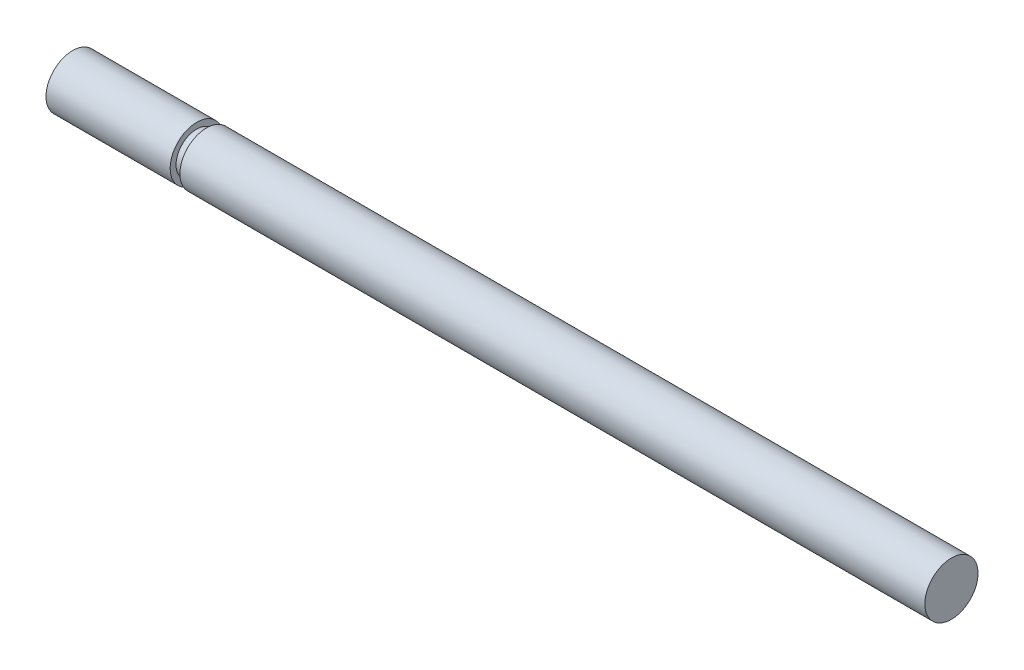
ISO-10303-21;
HEADER;
FILE_DESCRIPTION(('STEP AP214'),'2;1');
FILE_NAME('part.step','',(''),(''),'','','');
FILE_SCHEMA(('AUTOMOTIVE_DESIGN { 1 0 10303 214 1 1 1 1 }'));
ENDSEC;
DATA;
#1=APPLICATION_CONTEXT('core data for automotive mechanical design processes');
#2=APPLICATION_PROTOCOL_DEFINITION('international standard','automotive_design',2000,#1);
#3=PRODUCT_CONTEXT('',#1,'mechanical');
#4=PRODUCT('Part','Part','',(#3));
#5=PRODUCT_RELATED_PRODUCT_CATEGORY('part','',(#4));
#6=PRODUCT_DEFINITION_FORMATION('','',#4);
#7=PRODUCT_DEFINITION_CONTEXT('part definition',#1,'design');
#8=PRODUCT_DEFINITION('design','',#6,#7);
#9=PRODUCT_DEFINITION_SHAPE('','',#8);
#10=(LENGTH_UNIT() NAMED_UNIT(*) SI_UNIT(.MILLI.,.METRE.));
#11=(NAMED_UNIT(*) PLANE_ANGLE_UNIT() SI_UNIT($,.RADIAN.));
#12=(NAMED_UNIT(*) SI_UNIT($,.STERADIAN.) SOLID_ANGLE_UNIT());
#13=UNCERTAINTY_MEASURE_WITH_UNIT(LENGTH_MEASURE(1.E-05),#10,'distance_accuracy_value','');
#14=(GEOMETRIC_REPRESENTATION_CONTEXT(3) GLOBAL_UNCERTAINTY_ASSIGNED_CONTEXT((#13)) GLOBAL_UNIT_ASSIGNED_CONTEXT((#10,
#11,#12)) REPRESENTATION_CONTEXT('',''));
#15=CARTESIAN_POINT('',(0.,0.,0.));
#16=DIRECTION('',(0.,0.,1.));
#17=DIRECTION('',(1.,0.,0.));
#18=AXIS2_PLACEMENT_3D('',#15,#16,#17);
#19=CARTESIAN_POINT('',(1.125,0.,0.));
#20=DIRECTION('',(1.,0.,0.));
#21=DIRECTION('',(0.,0.,-1.));
#22=AXIS2_PLACEMENT_3D('',#19,#20,#21);
#23=PLANE('',#22);
#24=CARTESIAN_POINT('',(1.125,0.,0.));
#25=DIRECTION('',(-1.,0.,0.));
#26=DIRECTION('',(0.,0.,1.));
#27=AXIS2_PLACEMENT_3D('',#24,#25,#26);
#28=CIRCLE('',#27,1.5);
#29=CARTESIAN_POINT('',(1.125,0.,1.5));
#30=VERTEX_POINT('',#29);
#31=EDGE_CURVE('E10',#30,#30,#28,.T.);
#32=ORIENTED_EDGE('',*,*,#31,.T.);
#33=EDGE_LOOP('',(#32));
#34=FACE_BOUND('',#33,.T.);
#35=ADVANCED_FACE('F41',(#34),#23,.F.);
#36=CARTESIAN_POINT('',(0.,0.,0.));
#37=DIRECTION('',(-1.,0.,0.));
#38=DIRECTION('',(0.,0.,1.));
#39=AXIS2_PLACEMENT_3D('',#36,#37,#38);
#40=CYLINDRICAL_SURFACE('',#39,1.5);
#41=ORIENTED_EDGE('',*,*,#31,.F.);
#42=EDGE_LOOP('',(#41));
#43=FACE_BOUND('',#42,.T.);
#44=CARTESIAN_POINT('',(8.125,0.,0.));
#45=DIRECTION('',(-1.,0.,0.));
#46=DIRECTION('',(0.,0.,1.));
#47=AXIS2_PLACEMENT_3D('',#44,#45,#46);
#48=CIRCLE('',#47,1.5);
#49=CARTESIAN_POINT('',(8.125,0.,1.5));
#50=VERTEX_POINT('',#49);
#51=EDGE_CURVE('E50',#50,#50,#48,.T.);
#52=ORIENTED_EDGE('',*,*,#51,.T.);
#53=EDGE_LOOP('',(#52));
#54=FACE_BOUND('',#53,.T.);
#55=ADVANCED_FACE('F80',(#43,#54),#40,.T.);
#56=CARTESIAN_POINT('',(8.125,1.5,0.));
#57=DIRECTION('',(-1.,0.,0.));
#58=DIRECTION('',(0.,0.,1.));
#59=AXIS2_PLACEMENT_3D('',#56,#57,#58);
#60=PLANE('',#59);
#61=ORIENTED_EDGE('',*,*,#51,.F.);
#62=EDGE_LOOP('',(#61));
#63=FACE_BOUND('',#62,.T.);
#64=CARTESIAN_POINT('',(8.125,0.,0.));
#65=DIRECTION('',(-1.,0.,0.));
#66=DIRECTION('',(0.,0.,1.));
#67=AXIS2_PLACEMENT_3D('',#64,#65,#66);
#68=CIRCLE('',#67,1.16666666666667);
#69=CARTESIAN_POINT('',(8.125,0.,1.16666666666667));
#70=VERTEX_POINT('',#69);
#71=EDGE_CURVE('E51',#70,#70,#68,.T.);
#72=ORIENTED_EDGE('',*,*,#71,.T.);
#73=EDGE_LOOP('',(#72));
#74=FACE_BOUND('',#73,.T.);
#75=ADVANCED_FACE('F81',(#63,#74),#60,.F.);
#76=CARTESIAN_POINT('',(0.,0.,0.));
#77=DIRECTION('',(-1.,0.,0.));
#78=DIRECTION('',(0.,0.,1.));
#79=AXIS2_PLACEMENT_3D('',#76,#77,#78);
#80=CYLINDRICAL_SURFACE('',#79,1.16666666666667);
#81=ORIENTED_EDGE('',*,*,#71,.F.);
#82=EDGE_LOOP('',(#81));
#83=FACE_BOUND('',#82,.T.);
#84=CARTESIAN_POINT('',(8.675,0.,0.));
#85=DIRECTION('',(-1.,0.,0.));
#86=DIRECTION('',(0.,0.,1.));
#87=AXIS2_PLACEMENT_3D('',#84,#85,#86);
#88=CIRCLE('',#87,1.16666666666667);
#89=CARTESIAN_POINT('',(8.675,0.,1.16666666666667));
#90=VERTEX_POINT('',#89);
#91=EDGE_CURVE('E54',#90,#90,#88,.T.);
#92=ORIENTED_EDGE('',*,*,#91,.T.);
#93=EDGE_LOOP('',(#92));
#94=FACE_BOUND('',#93,.T.);
#95=ADVANCED_FACE('F88',(#83,#94),#80,.T.);
#96=CARTESIAN_POINT('',(8.675,1.16666666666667,0.));
#97=DIRECTION('',(1.,0.,0.));
#98=DIRECTION('',(0.,0.,-1.));
#99=AXIS2_PLACEMENT_3D('',#96,#97,#98);
#100=PLANE('',#99);
#101=ORIENTED_EDGE('',*,*,#91,.F.);
#102=EDGE_LOOP('',(#101));
#103=FACE_BOUND('',#102,.T.);
#104=CARTESIAN_POINT('',(8.675,0.,0.));
#105=DIRECTION('',(-1.,0.,0.));
#106=DIRECTION('',(0.,0.,1.));
#107=AXIS2_PLACEMENT_3D('',#104,#105,#106);
#108=CIRCLE('',#107,1.5);
#109=CARTESIAN_POINT('',(8.675,0.,1.5));
#110=VERTEX_POINT('',#109);
#111=EDGE_CURVE('E58',#110,#110,#108,.T.);
#112=ORIENTED_EDGE('',*,*,#111,.T.);
#113=EDGE_LOOP('',(#112));
#114=FACE_BOUND('',#113,.T.);
#115=ADVANCED_FACE('F71',(#103,#114),#100,.F.);
#116=CARTESIAN_POINT('',(0.,0.,0.));
#117=DIRECTION('',(-1.,0.,0.));
#118=DIRECTION('',(0.,0.,1.));
#119=AXIS2_PLACEMENT_3D('',#116,#117,#118);
#120=CYLINDRICAL_SURFACE('',#119,1.5);
#121=ORIENTED_EDGE('',*,*,#111,.F.);
#122=EDGE_LOOP('',(#121));
#123=FACE_BOUND('',#122,.T.);
#124=CARTESIAN_POINT('',(50.675,0.,0.));
#125=DIRECTION('',(-1.,0.,0.));
#126=DIRECTION('',(0.,0.,1.));
#127=AXIS2_PLACEMENT_3D('',#124,#125,#126);
#128=CIRCLE('',#127,1.5);
#129=CARTESIAN_POINT('',(50.675,0.,1.5));
#130=VERTEX_POINT('',#129);
#131=EDGE_CURVE('E63',#130,#130,#128,.T.);
#132=ORIENTED_EDGE('',*,*,#131,.T.);
#133=EDGE_LOOP('',(#132));
#134=FACE_BOUND('',#133,.T.);
#135=ADVANCED_FACE('F70',(#123,#134),#120,.T.);
#136=CARTESIAN_POINT('',(50.675,1.5,0.));
#137=DIRECTION('',(-1.,0.,0.));
#138=DIRECTION('',(0.,0.,1.));
#139=AXIS2_PLACEMENT_3D('',#136,#137,#138);
#140=PLANE('',#139);
#141=ORIENTED_EDGE('',*,*,#131,.F.);
#142=EDGE_LOOP('',(#141));
#143=FACE_BOUND('',#142,.T.);
#144=ADVANCED_FACE('F69',(#143),#140,.F.);
#145=CLOSED_SHELL('',(#35,#55,#75,#95,#115,#135,#144));
#146=MANIFOLD_SOLID_BREP('B2',#145);
#147=ADVANCED_BREP_SHAPE_REPRESENTATION('',(#18,#146),#14);
#148=SHAPE_DEFINITION_REPRESENTATION(#9,#147);
ENDSEC;
END-ISO-10303-21;
